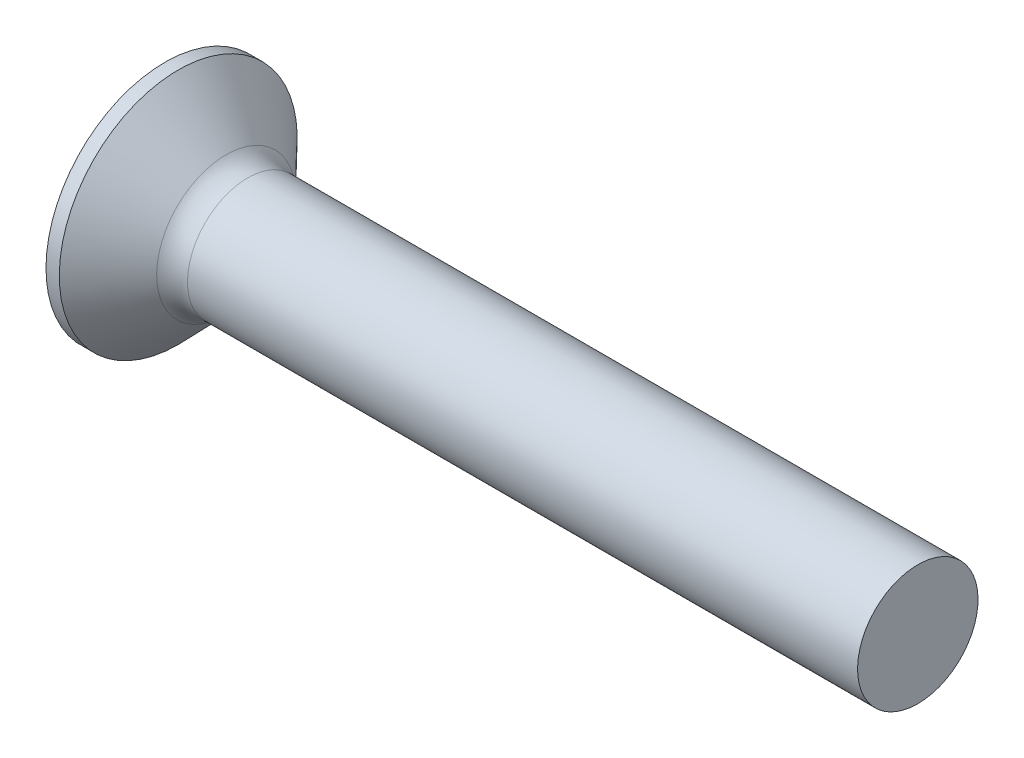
from build123d import *

# Parameters (mm, degrees)
FILLET1_R    = 2
RECPAT_COUNT = 2
RECPAT_ANGLE = 90


with BuildPart() as part:
    # BodySke → BaseBody (revolve)
    with BuildSketch(Plane.XY, mode=Mode.PRIVATE) as basebody_sk:
        with BuildLine():
            Line((2.01414483, 7.9), (2.897958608, 7.9))
            Line((2.897958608, 7.9), (6.66414483, 4))
            Line((6.66414483, 4), (52.01414483, 4))
            Line((52.01414483, 4), (52.01414483, 0))
            Line((52.01414483, 0), (2.01414483, 0))
            Line((2.01414483, 0), (0, 0))
            ThreePointArc((0, 0), (0.511463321, 4.076358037), (2.01414483, 7.9))
        make_face()
    revolve(basebody_sk.sketch.rotate(Axis((2.01414483, 0, 0), (1, 0, 0)), 180), axis=Axis((2.01414483, 0, 0), (1, 0, 0)))

    # Fillet1
    fillet1_edges = [part.edges().sort_by_distance(p)[0] for p in [
        (6.66414483, 4, 0),
    ]]
    fillet(fillet1_edges, radius=FILLET1_R)

    # RecSkeTop → Recess section 0
    with BuildSketch(Plane(origin=(0, 0, 0), x_dir=(0, 0, -1), z_dir=(1, 0, 0))):
        with BuildLine():
            Line((-0.946, 4.3), (0.946, 4.3))
            Line((0.946, 4.3), (0.946, -4.3))
            Line((0.946, -4.3), (-0.946, -4.3))
            Line((-0.946, -4.3), (-0.946, 4.3))
        make_face()
    # RecSkeBot → Recess section 1
    with BuildSketch(Plane(origin=(5.18, 0, 0), x_dir=(0, 0, -1), z_dir=(1, 0, 0))):
        with BuildLine():
            Line((-0.946, 1.717347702), (0.946, 1.717347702))
            Line((0.946, 1.717347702), (0.946, -1.717347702))
            Line((0.946, -1.717347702), (-0.946, -1.717347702))
            Line((-0.946, -1.717347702), (-0.946, 1.717347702))
        make_face()
    recess = loft(mode=Mode.SUBTRACT)

    # RecPat: Recess ×2 about axis
    recpat_axis = Axis((0, 0, 0), (1, 0, 0))
    for i in range(1, RECPAT_COUNT):
        add(recess.rotate(recpat_axis, i * RECPAT_ANGLE / (RECPAT_COUNT - 1)), mode=Mode.SUBTRACT)

    # RecCorSke → RecessCore (revolve, cut)
    with BuildSketch(Plane.XY, mode=Mode.PRIVATE) as recesscore_sk:
        Polygon((0, 0), (0, 2.0812), (5.18, 1.718979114), (5.738530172, 0), align=None)
    revolve(recesscore_sk.sketch.rotate(Axis((0, 0, 0), (1, 0, 0)), 90), axis=Axis((0, 0, 0), (1, 0, 0)), mode=Mode.SUBTRACT)


solid = part.part
